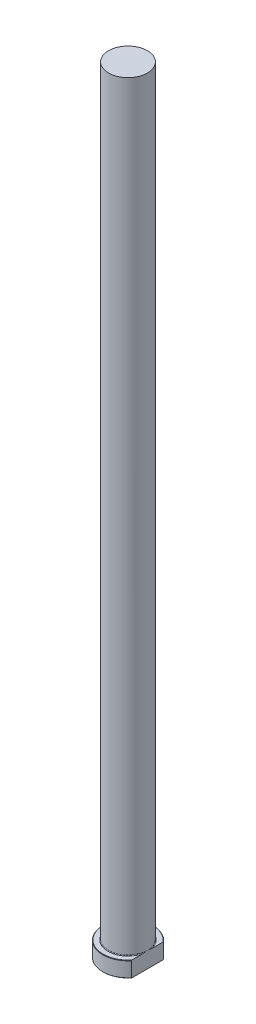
from build123d import *
from build123d.topology import SkipClean

# Parameters (mm, degrees)
CHAMFER1_SIZE = 0.2
FILLET1_R     = 0.3
KEY_DEPTH     = 401.422277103


with BuildPart() as part:
    # Sketch1 → Revolve1 (revolve)
    with BuildSketch(Plane.XY, mode=Mode.PRIVATE) as revolve1_sk:
        Polygon((0, 0), (-13, 0), (-13, 8), (-10, 8), (-10, 400), (0, 400), align=None)
    revolve(revolve1_sk.sketch.rotate(Axis((0, 259.958771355, 0), (0, -1, 0)), 270), axis=Axis((0, 259.958771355, 0), (0, -1, 0)))

    # Chamfer1
    chamfer1_edges = [part.edges().sort_by_distance(p)[0] for p in [
        (0, 8, -13),
        (0, 0, -13),
    ]]
    chamfer(chamfer1_edges, length=CHAMFER1_SIZE)

    # Fillet1
    fillet1_edges = [part.edges().sort_by_distance(p)[0] for p in [
        (0, 8, -10),
    ]]
    fillet(fillet1_edges, radius=FILLET1_R)

    # Sketch2 → KEY (cut, through all)
    with SkipClean():  # the faces are left unmerged after this step: merging them gives an invalid solid
        with BuildSketch(Plane(origin=(0, 0, 0), x_dir=(1, 0, 0), z_dir=(0, 1, 0))):
            with BuildLine():
                Line((10, 8.306623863), (10, -8.306623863))
                ThreePointArc((10, -8.306623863), (13, 0), (10, 8.306623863))
            make_face()
        extrude(amount=KEY_DEPTH, mode=Mode.SUBTRACT)


solid = part.part
